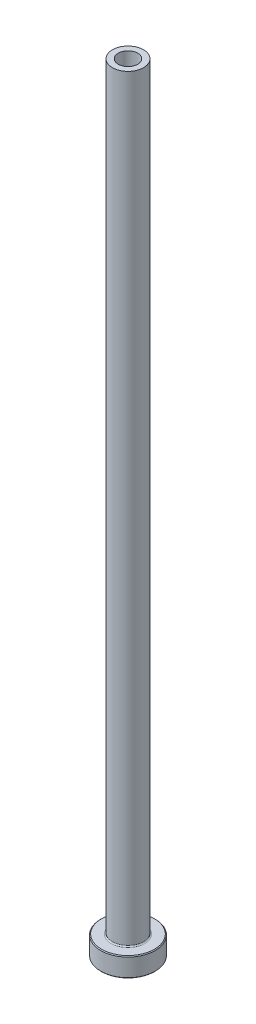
from build123d import *

# Parameters (mm, degrees)
FILLET1_R     = 0.3
CHAMFER1_SIZE = 0.2
CHAMFER3_SIZE = 0.5


with BuildPart() as part:
    # Sketch1 → Revolve1 (revolve)
    with BuildSketch(Plane.XY, mode=Mode.PRIVATE) as revolve1_sk:
        Polygon((-2.5, 200), (-4, 200), (-4, 5), (-7, 5), (-7, 0), (-2.75, 0), (-2.75, 143), (-2.5, 155), align=None)
    revolve(revolve1_sk.sketch.rotate(Axis((0, 92.187680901, 0), (0, -1, 0)), 270), axis=Axis((0, 92.187680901, 0), (0, -1, 0)))

    # Fillet1
    fillet1_edges = [part.edges().sort_by_distance(p)[0] for p in [
        (0, 5, -4),
    ]]
    fillet(fillet1_edges, radius=FILLET1_R)

    # Chamfer1
    chamfer1_edges = [part.edges().sort_by_distance(p)[0] for p in [
        (0, 0, -7),
        (0, 5, -7),
    ]]
    chamfer(chamfer1_edges, length=CHAMFER1_SIZE)

    # Chamfer3
    chamfer3_edges = [part.edges().sort_by_distance(p)[0] for p in [
        (0, 0, -2.75),
    ]]
    chamfer(chamfer3_edges, length=CHAMFER3_SIZE)


solid = part.part
